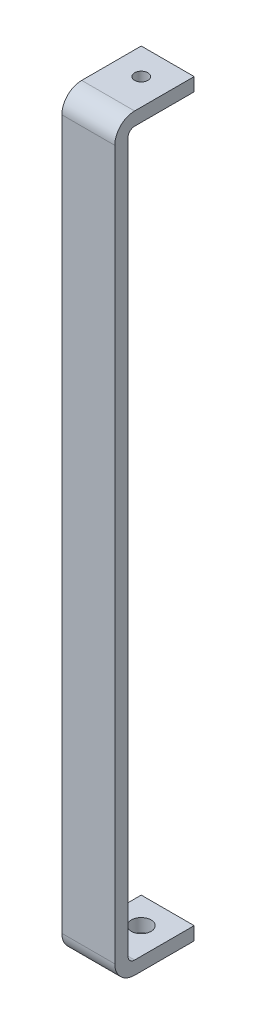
ISO-10303-21;
HEADER;
FILE_DESCRIPTION(('STEP AP214'),'2;1');
FILE_NAME('part.step','',(''),(''),'','','');
FILE_SCHEMA(('AUTOMOTIVE_DESIGN { 1 0 10303 214 1 1 1 1 }'));
ENDSEC;
DATA;
#1=APPLICATION_CONTEXT('core data for automotive mechanical design processes');
#2=APPLICATION_PROTOCOL_DEFINITION('international standard','automotive_design',2000,#1);
#3=PRODUCT_CONTEXT('',#1,'mechanical');
#4=PRODUCT('Part','Part','',(#3));
#5=PRODUCT_RELATED_PRODUCT_CATEGORY('part','',(#4));
#6=PRODUCT_DEFINITION_FORMATION('','',#4);
#7=PRODUCT_DEFINITION_CONTEXT('part definition',#1,'design');
#8=PRODUCT_DEFINITION('design','',#6,#7);
#9=PRODUCT_DEFINITION_SHAPE('','',#8);
#10=(LENGTH_UNIT() NAMED_UNIT(*) SI_UNIT(.MILLI.,.METRE.));
#11=(NAMED_UNIT(*) PLANE_ANGLE_UNIT() SI_UNIT($,.RADIAN.));
#12=(NAMED_UNIT(*) SI_UNIT($,.STERADIAN.) SOLID_ANGLE_UNIT());
#13=UNCERTAINTY_MEASURE_WITH_UNIT(LENGTH_MEASURE(1.E-05),#10,'distance_accuracy_value','');
#14=(GEOMETRIC_REPRESENTATION_CONTEXT(3) GLOBAL_UNCERTAINTY_ASSIGNED_CONTEXT((#13)) GLOBAL_UNIT_ASSIGNED_CONTEXT((#10,
#11,#12)) REPRESENTATION_CONTEXT('',''));
#15=CARTESIAN_POINT('',(0.,0.,0.));
#16=DIRECTION('',(0.,0.,1.));
#17=DIRECTION('',(1.,0.,0.));
#18=AXIS2_PLACEMENT_3D('',#15,#16,#17);
#19=CARTESIAN_POINT('',(-14.2875000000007,-172.72,3.175));
#20=DIRECTION('',(0.,0.,1.));
#21=DIRECTION('',(1.,0.,0.));
#22=AXIS2_PLACEMENT_3D('',#19,#20,#21);
#23=PLANE('',#22);
#24=DIRECTION('',(0.,-1.,0.));
#25=VECTOR('',#24,1.);
#26=CARTESIAN_POINT('',(-14.2875000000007,6.85800000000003,3.175));
#27=LINE('',#26,#25);
#28=CARTESIAN_POINT('',(-14.2875000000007,2.09550000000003,3.175));
#29=VERTEX_POINT('',#28);
#30=CARTESIAN_POINT('',(-14.2875000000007,-167.9575,3.175));
#31=VERTEX_POINT('',#30);
#32=EDGE_CURVE('E158',#29,#31,#27,.T.);
#33=ORIENTED_EDGE('',*,*,#32,.F.);
#34=DIRECTION('',(1.,0.,0.));
#35=VECTOR('',#34,1.);
#36=CARTESIAN_POINT('',(-14.2875000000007,2.09550000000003,3.175));
#37=LINE('',#36,#35);
#38=CARTESIAN_POINT('',(-1.58750000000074,2.09550000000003,3.175));
#39=VERTEX_POINT('',#38);
#40=EDGE_CURVE('E174',#29,#39,#37,.T.);
#41=ORIENTED_EDGE('',*,*,#40,.T.);
#42=DIRECTION('',(0.,1.,0.));
#43=VECTOR('',#42,1.);
#44=CARTESIAN_POINT('',(-1.58750000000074,6.85800000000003,3.175));
#45=LINE('',#44,#43);
#46=CARTESIAN_POINT('',(-1.58750000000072,-167.9575,3.175));
#47=VERTEX_POINT('',#46);
#48=EDGE_CURVE('E167',#47,#39,#45,.T.);
#49=ORIENTED_EDGE('',*,*,#48,.F.);
#50=DIRECTION('',(1.,0.,0.));
#51=VECTOR('',#50,1.);
#52=CARTESIAN_POINT('',(-14.2875000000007,-167.9575,3.175));
#53=LINE('',#52,#51);
#54=EDGE_CURVE('E172',#47,#31,#53,.F.);
#55=ORIENTED_EDGE('',*,*,#54,.T.);
#56=EDGE_LOOP('',(#33,#41,#49,#55));
#57=FACE_BOUND('',#56,.T.);
#58=ADVANCED_FACE('F33',(#57),#23,.F.);
#59=CARTESIAN_POINT('',(-14.2875000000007,3.68300000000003,-12.7));
#60=DIRECTION('',(-1.,0.,0.));
#61=DIRECTION('',(0.,0.,1.));
#62=AXIS2_PLACEMENT_3D('',#59,#60,#61);
#63=PLANE('',#62);
#64=DIRECTION('',(0.,-1.,0.));
#65=VECTOR('',#64,1.);
#66=CARTESIAN_POINT('',(-14.2875000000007,6.85800000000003,6.35));
#67=LINE('',#66,#65);
#68=CARTESIAN_POINT('',(-14.2875000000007,2.09550000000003,6.35));
#69=VERTEX_POINT('',#68);
#70=CARTESIAN_POINT('',(-14.2875000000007,-167.9575,6.35));
#71=VERTEX_POINT('',#70);
#72=EDGE_CURVE('E171',#69,#71,#67,.T.);
#73=ORIENTED_EDGE('',*,*,#72,.F.);
#74=CARTESIAN_POINT('',(-14.2875000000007,2.09550000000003,1.5875));
#75=DIRECTION('',(-1.,0.,0.));
#76=DIRECTION('',(0.,0.,1.));
#77=AXIS2_PLACEMENT_3D('',#74,#75,#76);
#78=CIRCLE('',#77,4.7625);
#79=CARTESIAN_POINT('',(-14.2875000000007,6.85800000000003,1.5875));
#80=VERTEX_POINT('',#79);
#81=EDGE_CURVE('E199',#69,#80,#78,.T.);
#82=ORIENTED_EDGE('',*,*,#81,.T.);
#83=DIRECTION('',(0.,0.,1.));
#84=VECTOR('',#83,1.);
#85=CARTESIAN_POINT('',(-14.2875000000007,6.85800000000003,-12.7));
#86=LINE('',#85,#84);
#87=CARTESIAN_POINT('',(-14.2875000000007,6.85800000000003,-12.7));
#88=VERTEX_POINT('',#87);
#89=EDGE_CURVE('E175',#88,#80,#86,.T.);
#90=ORIENTED_EDGE('',*,*,#89,.F.);
#91=DIRECTION('',(0.,-1.,0.));
#92=VECTOR('',#91,1.);
#93=CARTESIAN_POINT('',(-14.2875000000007,3.68300000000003,-12.7));
#94=LINE('',#93,#92);
#95=CARTESIAN_POINT('',(-14.2875000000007,3.68300000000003,-12.7));
#96=VERTEX_POINT('',#95);
#97=EDGE_CURVE('E241',#88,#96,#94,.T.);
#98=ORIENTED_EDGE('',*,*,#97,.T.);
#99=DIRECTION('',(0.,0.,1.));
#100=VECTOR('',#99,1.);
#101=CARTESIAN_POINT('',(-14.2875000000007,3.68300000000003,-12.7));
#102=LINE('',#101,#100);
#103=CARTESIAN_POINT('',(-14.2875000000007,3.68300000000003,1.5875));
#104=VERTEX_POINT('',#103);
#105=EDGE_CURVE('E230',#96,#104,#102,.T.);
#106=ORIENTED_EDGE('',*,*,#105,.T.);
#107=CARTESIAN_POINT('',(-14.2875000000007,2.09550000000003,1.5875));
#108=DIRECTION('',(-1.,0.,0.));
#109=DIRECTION('',(0.,0.,1.));
#110=AXIS2_PLACEMENT_3D('',#107,#108,#109);
#111=CIRCLE('',#110,1.5875);
#112=EDGE_CURVE('E185',#104,#29,#111,.F.);
#113=ORIENTED_EDGE('',*,*,#112,.T.);
#114=ORIENTED_EDGE('',*,*,#32,.T.);
#115=CARTESIAN_POINT('',(-14.2875000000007,-167.9575,1.5875));
#116=DIRECTION('',(-1.,0.,0.));
#117=DIRECTION('',(0.,0.,1.));
#118=AXIS2_PLACEMENT_3D('',#115,#116,#117);
#119=CIRCLE('',#118,1.5875);
#120=CARTESIAN_POINT('',(-14.2875000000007,-169.545,1.5875));
#121=VERTEX_POINT('',#120);
#122=EDGE_CURVE('E189',#31,#121,#119,.F.);
#123=ORIENTED_EDGE('',*,*,#122,.T.);
#124=DIRECTION('',(0.,0.,1.));
#125=VECTOR('',#124,1.);
#126=CARTESIAN_POINT('',(-14.2875000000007,-169.545,-12.7));
#127=LINE('',#126,#125);
#128=CARTESIAN_POINT('',(-14.2875000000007,-169.545,-12.7));
#129=VERTEX_POINT('',#128);
#130=EDGE_CURVE('E155',#129,#121,#127,.T.);
#131=ORIENTED_EDGE('',*,*,#130,.F.);
#132=DIRECTION('',(0.,1.,0.));
#133=VECTOR('',#132,1.);
#134=CARTESIAN_POINT('',(-14.2875000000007,-172.72,-12.7));
#135=LINE('',#134,#133);
#136=CARTESIAN_POINT('',(-14.2875000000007,-172.72,-12.7));
#137=VERTEX_POINT('',#136);
#138=EDGE_CURVE('E137',#137,#129,#135,.T.);
#139=ORIENTED_EDGE('',*,*,#138,.F.);
#140=DIRECTION('',(0.,0.,-1.));
#141=VECTOR('',#140,1.);
#142=CARTESIAN_POINT('',(-14.2875000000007,-172.72,6.35));
#143=LINE('',#142,#141);
#144=CARTESIAN_POINT('',(-14.2875000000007,-172.72,1.5875));
#145=VERTEX_POINT('',#144);
#146=EDGE_CURVE('E128',#145,#137,#143,.T.);
#147=ORIENTED_EDGE('',*,*,#146,.F.);
#148=CARTESIAN_POINT('',(-14.2875000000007,-167.9575,1.5875));
#149=DIRECTION('',(-1.,0.,0.));
#150=DIRECTION('',(0.,0.,1.));
#151=AXIS2_PLACEMENT_3D('',#148,#149,#150);
#152=CIRCLE('',#151,4.7625);
#153=EDGE_CURVE('E197',#145,#71,#152,.T.);
#154=ORIENTED_EDGE('',*,*,#153,.T.);
#155=EDGE_LOOP('',(#73,#82,#90,#98,#106,#113,#114,#123,#131,#139,#147,#154));
#156=FACE_BOUND('',#155,.T.);
#157=ADVANCED_FACE('F35',(#156),#63,.T.);
#158=CARTESIAN_POINT('',(-14.2875000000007,6.85800000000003,-12.7));
#159=DIRECTION('',(0.,1.,0.));
#160=DIRECTION('',(-1.,0.,0.));
#161=AXIS2_PLACEMENT_3D('',#158,#159,#160);
#162=PLANE('',#161);
#163=CARTESIAN_POINT('',(-7.93750000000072,6.85800000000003,-6.35));
#164=DIRECTION('',(0.,1.,0.));
#165=DIRECTION('',(0.,0.,1.));
#166=AXIS2_PLACEMENT_3D('',#163,#164,#165);
#167=CIRCLE('',#166,1.5875);
#168=CARTESIAN_POINT('',(-7.93750000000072,6.85800000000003,-4.7625));
#169=VERTEX_POINT('',#168);
#170=EDGE_CURVE('E303',#169,#169,#167,.T.);
#171=ORIENTED_EDGE('',*,*,#170,.F.);
#172=EDGE_LOOP('',(#171));
#173=FACE_BOUND('',#172,.T.);
#174=ORIENTED_EDGE('',*,*,#89,.T.);
#175=DIRECTION('',(-1.,0.,0.));
#176=VECTOR('',#175,1.);
#177=CARTESIAN_POINT('',(-14.2875000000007,6.85800000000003,1.5875));
#178=LINE('',#177,#176);
#179=CARTESIAN_POINT('',(-1.58750000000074,6.85800000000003,1.5875));
#180=VERTEX_POINT('',#179);
#181=EDGE_CURVE('E56',#80,#180,#178,.F.);
#182=ORIENTED_EDGE('',*,*,#181,.T.);
#183=DIRECTION('',(0.,0.,1.));
#184=VECTOR('',#183,1.);
#185=CARTESIAN_POINT('',(-1.58750000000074,6.85800000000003,-12.7));
#186=LINE('',#185,#184);
#187=CARTESIAN_POINT('',(-1.58750000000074,6.85800000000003,-12.7));
#188=VERTEX_POINT('',#187);
#189=EDGE_CURVE('E205',#188,#180,#186,.T.);
#190=ORIENTED_EDGE('',*,*,#189,.F.);
#191=DIRECTION('',(-1.,0.,0.));
#192=VECTOR('',#191,1.);
#193=CARTESIAN_POINT('',(-14.2875000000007,6.85800000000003,-12.7));
#194=LINE('',#193,#192);
#195=EDGE_CURVE('E221',#188,#88,#194,.T.);
#196=ORIENTED_EDGE('',*,*,#195,.T.);
#197=EDGE_LOOP('',(#174,#182,#190,#196));
#198=FACE_BOUND('',#197,.T.);
#199=ADVANCED_FACE('F219',(#173,#198),#162,.T.);
#200=CARTESIAN_POINT('',(-1.58750000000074,3.68300000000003,-12.7));
#201=DIRECTION('',(1.,0.,0.));
#202=DIRECTION('',(0.,0.,-1.));
#203=AXIS2_PLACEMENT_3D('',#200,#201,#202);
#204=PLANE('',#203);
#205=ORIENTED_EDGE('',*,*,#189,.T.);
#206=CARTESIAN_POINT('',(-1.58750000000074,2.09550000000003,1.5875));
#207=DIRECTION('',(1.,0.,0.));
#208=DIRECTION('',(0.,0.,-1.));
#209=AXIS2_PLACEMENT_3D('',#206,#207,#208);
#210=CIRCLE('',#209,4.7625);
#211=CARTESIAN_POINT('',(-1.58750000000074,2.09550000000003,6.35));
#212=VERTEX_POINT('',#211);
#213=EDGE_CURVE('E41',#180,#212,#210,.T.);
#214=ORIENTED_EDGE('',*,*,#213,.T.);
#215=DIRECTION('',(0.,1.,0.));
#216=VECTOR('',#215,1.);
#217=CARTESIAN_POINT('',(-1.58750000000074,6.85800000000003,6.35));
#218=LINE('',#217,#216);
#219=CARTESIAN_POINT('',(-1.58750000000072,-167.9575,6.35));
#220=VERTEX_POINT('',#219);
#221=EDGE_CURVE('E129',#220,#212,#218,.T.);
#222=ORIENTED_EDGE('',*,*,#221,.F.);
#223=CARTESIAN_POINT('',(-1.58750000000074,-167.9575,1.5875));
#224=DIRECTION('',(1.,0.,0.));
#225=DIRECTION('',(0.,0.,-1.));
#226=AXIS2_PLACEMENT_3D('',#223,#224,#225);
#227=CIRCLE('',#226,4.7625);
#228=CARTESIAN_POINT('',(-1.58750000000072,-172.72,1.5875));
#229=VERTEX_POINT('',#228);
#230=EDGE_CURVE('E48',#220,#229,#227,.T.);
#231=ORIENTED_EDGE('',*,*,#230,.T.);
#232=DIRECTION('',(0.,0.,-1.));
#233=VECTOR('',#232,1.);
#234=CARTESIAN_POINT('',(-1.58750000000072,-172.72,6.35));
#235=LINE('',#234,#233);
#236=CARTESIAN_POINT('',(-1.58750000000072,-172.72,-12.7));
#237=VERTEX_POINT('',#236);
#238=EDGE_CURVE('E120',#229,#237,#235,.T.);
#239=ORIENTED_EDGE('',*,*,#238,.T.);
#240=DIRECTION('',(0.,-1.,0.));
#241=VECTOR('',#240,1.);
#242=CARTESIAN_POINT('',(-1.58750000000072,-172.72,-12.7));
#243=LINE('',#242,#241);
#244=CARTESIAN_POINT('',(-1.58750000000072,-169.545,-12.7));
#245=VERTEX_POINT('',#244);
#246=EDGE_CURVE('E125',#245,#237,#243,.T.);
#247=ORIENTED_EDGE('',*,*,#246,.F.);
#248=DIRECTION('',(0.,0.,1.));
#249=VECTOR('',#248,1.);
#250=CARTESIAN_POINT('',(-1.58750000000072,-169.545,-12.7));
#251=LINE('',#250,#249);
#252=CARTESIAN_POINT('',(-1.58750000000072,-169.545,1.5875));
#253=VERTEX_POINT('',#252);
#254=EDGE_CURVE('E153',#245,#253,#251,.T.);
#255=ORIENTED_EDGE('',*,*,#254,.T.);
#256=CARTESIAN_POINT('',(-1.58750000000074,-167.9575,1.5875));
#257=DIRECTION('',(1.,0.,0.));
#258=DIRECTION('',(0.,0.,-1.));
#259=AXIS2_PLACEMENT_3D('',#256,#257,#258);
#260=CIRCLE('',#259,1.5875);
#261=EDGE_CURVE('E187',#253,#47,#260,.F.);
#262=ORIENTED_EDGE('',*,*,#261,.T.);
#263=ORIENTED_EDGE('',*,*,#48,.T.);
#264=CARTESIAN_POINT('',(-1.58750000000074,2.09550000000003,1.5875));
#265=DIRECTION('',(1.,0.,0.));
#266=DIRECTION('',(0.,0.,-1.));
#267=AXIS2_PLACEMENT_3D('',#264,#265,#266);
#268=CIRCLE('',#267,1.5875);
#269=CARTESIAN_POINT('',(-1.58750000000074,3.68300000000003,1.5875));
#270=VERTEX_POINT('',#269);
#271=EDGE_CURVE('E183',#39,#270,#268,.F.);
#272=ORIENTED_EDGE('',*,*,#271,.T.);
#273=DIRECTION('',(0.,0.,1.));
#274=VECTOR('',#273,1.);
#275=CARTESIAN_POINT('',(-1.58750000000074,3.68300000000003,-12.7));
#276=LINE('',#275,#274);
#277=CARTESIAN_POINT('',(-1.58750000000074,3.68300000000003,-12.7));
#278=VERTEX_POINT('',#277);
#279=EDGE_CURVE('E223',#278,#270,#276,.T.);
#280=ORIENTED_EDGE('',*,*,#279,.F.);
#281=DIRECTION('',(0.,1.,0.));
#282=VECTOR('',#281,1.);
#283=CARTESIAN_POINT('',(-1.58750000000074,3.68300000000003,-12.7));
#284=LINE('',#283,#282);
#285=EDGE_CURVE('E237',#278,#188,#284,.T.);
#286=ORIENTED_EDGE('',*,*,#285,.T.);
#287=EDGE_LOOP('',(#205,#214,#222,#231,#239,#247,#255,#262,#263,#272,#280,#286));
#288=FACE_BOUND('',#287,.T.);
#289=ADVANCED_FACE('F122',(#288),#204,.T.);
#290=CARTESIAN_POINT('',(-14.2875000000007,3.68300000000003,-12.7));
#291=DIRECTION('',(0.,-1.,0.));
#292=DIRECTION('',(1.,0.,0.));
#293=AXIS2_PLACEMENT_3D('',#290,#291,#292);
#294=PLANE('',#293);
#295=CARTESIAN_POINT('',(-7.93750000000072,3.68300000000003,-6.35));
#296=DIRECTION('',(0.,-1.,0.));
#297=DIRECTION('',(1.,0.,0.));
#298=AXIS2_PLACEMENT_3D('',#295,#296,#297);
#299=CIRCLE('',#298,1.5875);
#300=CARTESIAN_POINT('',(-6.35000000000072,3.68300000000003,-6.35));
#301=VERTEX_POINT('',#300);
#302=EDGE_CURVE('E168',#301,#301,#299,.T.);
#303=ORIENTED_EDGE('',*,*,#302,.F.);
#304=EDGE_LOOP('',(#303));
#305=FACE_BOUND('',#304,.T.);
#306=ORIENTED_EDGE('',*,*,#279,.T.);
#307=DIRECTION('',(1.,0.,0.));
#308=VECTOR('',#307,1.);
#309=CARTESIAN_POINT('',(-14.2875000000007,3.68300000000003,1.5875));
#310=LINE('',#309,#308);
#311=EDGE_CURVE('E178',#270,#104,#310,.F.);
#312=ORIENTED_EDGE('',*,*,#311,.T.);
#313=ORIENTED_EDGE('',*,*,#105,.F.);
#314=DIRECTION('',(1.,0.,0.));
#315=VECTOR('',#314,1.);
#316=CARTESIAN_POINT('',(-14.2875000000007,3.68300000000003,-12.7));
#317=LINE('',#316,#315);
#318=EDGE_CURVE('E238',#96,#278,#317,.T.);
#319=ORIENTED_EDGE('',*,*,#318,.T.);
#320=EDGE_LOOP('',(#306,#312,#313,#319));
#321=FACE_BOUND('',#320,.T.);
#322=ADVANCED_FACE('F287',(#305,#321),#294,.T.);
#323=CARTESIAN_POINT('',(-14.2875000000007,6.85800000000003,-12.7));
#324=DIRECTION('',(0.,0.,-1.));
#325=DIRECTION('',(-1.,0.,0.));
#326=AXIS2_PLACEMENT_3D('',#323,#324,#325);
#327=PLANE('',#326);
#328=ORIENTED_EDGE('',*,*,#97,.F.);
#329=ORIENTED_EDGE('',*,*,#195,.F.);
#330=ORIENTED_EDGE('',*,*,#285,.F.);
#331=ORIENTED_EDGE('',*,*,#318,.F.);
#332=EDGE_LOOP('',(#328,#329,#330,#331));
#333=FACE_BOUND('',#332,.T.);
#334=ADVANCED_FACE('F283',(#333),#327,.T.);
#335=CARTESIAN_POINT('',(-14.2875000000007,-172.72,6.35));
#336=DIRECTION('',(0.,1.,0.));
#337=DIRECTION('',(0.,0.,1.));
#338=AXIS2_PLACEMENT_3D('',#335,#336,#337);
#339=PLANE('',#338);
#340=CARTESIAN_POINT('',(-7.93750000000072,-172.72,-6.35));
#341=DIRECTION('',(0.,-1.,0.));
#342=DIRECTION('',(0.,0.,-1.));
#343=AXIS2_PLACEMENT_3D('',#340,#341,#342);
#344=CIRCLE('',#343,2.3749);
#345=CARTESIAN_POINT('',(-7.93750000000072,-172.72,-8.7249));
#346=VERTEX_POINT('',#345);
#347=EDGE_CURVE('E146',#346,#346,#344,.T.);
#348=ORIENTED_EDGE('',*,*,#347,.F.);
#349=EDGE_LOOP('',(#348));
#350=FACE_BOUND('',#349,.T.);
#351=ORIENTED_EDGE('',*,*,#238,.F.);
#352=DIRECTION('',(1.,0.,0.));
#353=VECTOR('',#352,1.);
#354=CARTESIAN_POINT('',(-14.2875000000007,-172.72,1.5875));
#355=LINE('',#354,#353);
#356=EDGE_CURVE('E11',#229,#145,#355,.F.);
#357=ORIENTED_EDGE('',*,*,#356,.T.);
#358=ORIENTED_EDGE('',*,*,#146,.T.);
#359=DIRECTION('',(-1.,0.,0.));
#360=VECTOR('',#359,1.);
#361=CARTESIAN_POINT('',(-1.58750000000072,-172.72,-12.7));
#362=LINE('',#361,#360);
#363=EDGE_CURVE('E132',#237,#137,#362,.T.);
#364=ORIENTED_EDGE('',*,*,#363,.F.);
#365=EDGE_LOOP('',(#351,#357,#358,#364));
#366=FACE_BOUND('',#365,.T.);
#367=ADVANCED_FACE('F133',(#350,#366),#339,.F.);
#368=CARTESIAN_POINT('',(-14.2875000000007,-172.72,6.35));
#369=DIRECTION('',(0.,0.,1.));
#370=DIRECTION('',(1.,0.,0.));
#371=AXIS2_PLACEMENT_3D('',#368,#369,#370);
#372=PLANE('',#371);
#373=ORIENTED_EDGE('',*,*,#221,.T.);
#374=DIRECTION('',(-1.,0.,0.));
#375=VECTOR('',#374,1.);
#376=CARTESIAN_POINT('',(-14.2875000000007,2.09550000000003,6.35));
#377=LINE('',#376,#375);
#378=EDGE_CURVE('E194',#212,#69,#377,.T.);
#379=ORIENTED_EDGE('',*,*,#378,.T.);
#380=ORIENTED_EDGE('',*,*,#72,.T.);
#381=DIRECTION('',(1.,0.,0.));
#382=VECTOR('',#381,1.);
#383=CARTESIAN_POINT('',(-1.58750000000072,-167.9575,6.35));
#384=LINE('',#383,#382);
#385=EDGE_CURVE('E191',#71,#220,#384,.T.);
#386=ORIENTED_EDGE('',*,*,#385,.T.);
#387=EDGE_LOOP('',(#373,#379,#380,#386));
#388=FACE_BOUND('',#387,.T.);
#389=ADVANCED_FACE('F209',(#388),#372,.T.);
#390=CARTESIAN_POINT('',(-1.58750000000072,-169.545,-12.7));
#391=DIRECTION('',(0.,-1.,0.));
#392=DIRECTION('',(0.,0.,-1.));
#393=AXIS2_PLACEMENT_3D('',#390,#391,#392);
#394=PLANE('',#393);
#395=CARTESIAN_POINT('',(-7.93750000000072,-169.545,-6.35));
#396=DIRECTION('',(0.,-1.,0.));
#397=DIRECTION('',(0.,0.,-1.));
#398=AXIS2_PLACEMENT_3D('',#395,#396,#397);
#399=CIRCLE('',#398,2.3749);
#400=CARTESIAN_POINT('',(-7.93750000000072,-169.545,-8.7249));
#401=VERTEX_POINT('',#400);
#402=EDGE_CURVE('E143',#401,#401,#399,.T.);
#403=ORIENTED_EDGE('',*,*,#402,.T.);
#404=EDGE_LOOP('',(#403));
#405=FACE_BOUND('',#404,.T.);
#406=ORIENTED_EDGE('',*,*,#130,.T.);
#407=DIRECTION('',(1.,0.,0.));
#408=VECTOR('',#407,1.);
#409=CARTESIAN_POINT('',(-1.58750000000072,-169.545,1.5875));
#410=LINE('',#409,#408);
#411=EDGE_CURVE('E180',#121,#253,#410,.T.);
#412=ORIENTED_EDGE('',*,*,#411,.T.);
#413=ORIENTED_EDGE('',*,*,#254,.F.);
#414=DIRECTION('',(1.,0.,0.));
#415=VECTOR('',#414,1.);
#416=CARTESIAN_POINT('',(-1.58750000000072,-169.545,-12.7));
#417=LINE('',#416,#415);
#418=EDGE_CURVE('E141',#129,#245,#417,.T.);
#419=ORIENTED_EDGE('',*,*,#418,.F.);
#420=EDGE_LOOP('',(#406,#412,#413,#419));
#421=FACE_BOUND('',#420,.T.);
#422=ADVANCED_FACE('F252',(#405,#421),#394,.F.);
#423=CARTESIAN_POINT('',(-1.58750000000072,-169.545,-12.7));
#424=DIRECTION('',(0.,0.,1.));
#425=DIRECTION('',(1.,0.,0.));
#426=AXIS2_PLACEMENT_3D('',#423,#424,#425);
#427=PLANE('',#426);
#428=ORIENTED_EDGE('',*,*,#246,.T.);
#429=ORIENTED_EDGE('',*,*,#363,.T.);
#430=ORIENTED_EDGE('',*,*,#138,.T.);
#431=ORIENTED_EDGE('',*,*,#418,.T.);
#432=EDGE_LOOP('',(#428,#429,#430,#431));
#433=FACE_BOUND('',#432,.T.);
#434=ADVANCED_FACE('F139',(#433),#427,.F.);
#435=CARTESIAN_POINT('',(-7.93750000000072,-160.02,-6.35));
#436=DIRECTION('',(0.,-1.,0.));
#437=DIRECTION('',(0.,0.,-1.));
#438=AXIS2_PLACEMENT_3D('',#435,#436,#437);
#439=CYLINDRICAL_SURFACE('',#438,2.3749);
#440=ORIENTED_EDGE('',*,*,#347,.T.);
#441=EDGE_LOOP('',(#440));
#442=FACE_BOUND('',#441,.T.);
#443=ORIENTED_EDGE('',*,*,#402,.F.);
#444=EDGE_LOOP('',(#443));
#445=FACE_BOUND('',#444,.T.);
#446=ADVANCED_FACE('F309',(#442,#445),#439,.F.);
#447=CARTESIAN_POINT('',(-7.93750000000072,-5.84199999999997,-6.35));
#448=DIRECTION('',(0.,1.,0.));
#449=DIRECTION('',(0.,0.,1.));
#450=AXIS2_PLACEMENT_3D('',#447,#448,#449);
#451=CYLINDRICAL_SURFACE('',#450,1.5875);
#452=ORIENTED_EDGE('',*,*,#302,.T.);
#453=EDGE_LOOP('',(#452));
#454=FACE_BOUND('',#453,.T.);
#455=ORIENTED_EDGE('',*,*,#170,.T.);
#456=EDGE_LOOP('',(#455));
#457=FACE_BOUND('',#456,.T.);
#458=ADVANCED_FACE('F268',(#454,#457),#451,.F.);
#459=CARTESIAN_POINT('',(-14.2875000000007,2.09550000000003,1.5875));
#460=DIRECTION('',(1.,0.,0.));
#461=DIRECTION('',(0.,1.,0.));
#462=AXIS2_PLACEMENT_3D('',#459,#460,#461);
#463=CYLINDRICAL_SURFACE('',#462,1.5875);
#464=ORIENTED_EDGE('',*,*,#112,.F.);
#465=ORIENTED_EDGE('',*,*,#311,.F.);
#466=ORIENTED_EDGE('',*,*,#271,.F.);
#467=ORIENTED_EDGE('',*,*,#40,.F.);
#468=EDGE_LOOP('',(#464,#465,#466,#467));
#469=FACE_BOUND('',#468,.T.);
#470=ADVANCED_FACE('F261',(#469),#463,.F.);
#471=CARTESIAN_POINT('',(-1.58750000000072,-167.9575,1.5875));
#472=DIRECTION('',(-1.,0.,0.));
#473=DIRECTION('',(0.,0.,1.));
#474=AXIS2_PLACEMENT_3D('',#471,#472,#473);
#475=CYLINDRICAL_SURFACE('',#474,1.5875);
#476=ORIENTED_EDGE('',*,*,#122,.F.);
#477=ORIENTED_EDGE('',*,*,#54,.F.);
#478=ORIENTED_EDGE('',*,*,#261,.F.);
#479=ORIENTED_EDGE('',*,*,#411,.F.);
#480=EDGE_LOOP('',(#476,#477,#478,#479));
#481=FACE_BOUND('',#480,.T.);
#482=ADVANCED_FACE('F259',(#481),#475,.F.);
#483=CARTESIAN_POINT('',(-14.2875000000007,2.09550000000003,1.5875));
#484=DIRECTION('',(-1.,0.,0.));
#485=DIRECTION('',(0.,-1.,0.));
#486=AXIS2_PLACEMENT_3D('',#483,#484,#485);
#487=CYLINDRICAL_SURFACE('',#486,4.7625);
#488=ORIENTED_EDGE('',*,*,#213,.F.);
#489=ORIENTED_EDGE('',*,*,#181,.F.);
#490=ORIENTED_EDGE('',*,*,#81,.F.);
#491=ORIENTED_EDGE('',*,*,#378,.F.);
#492=EDGE_LOOP('',(#488,#489,#490,#491));
#493=FACE_BOUND('',#492,.T.);
#494=ADVANCED_FACE('F214',(#493),#487,.T.);
#495=CARTESIAN_POINT('',(-14.2875000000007,-167.9575,1.5875));
#496=DIRECTION('',(-1.,0.,0.));
#497=DIRECTION('',(0.,0.,1.));
#498=AXIS2_PLACEMENT_3D('',#495,#496,#497);
#499=CYLINDRICAL_SURFACE('',#498,4.7625);
#500=ORIENTED_EDGE('',*,*,#153,.F.);
#501=ORIENTED_EDGE('',*,*,#356,.F.);
#502=ORIENTED_EDGE('',*,*,#230,.F.);
#503=ORIENTED_EDGE('',*,*,#385,.F.);
#504=EDGE_LOOP('',(#500,#501,#502,#503));
#505=FACE_BOUND('',#504,.T.);
#506=ADVANCED_FACE('F247',(#505),#499,.T.);
#507=CLOSED_SHELL('',(#58,#157,#199,#289,#322,#334,#367,#389,#422,#434,#446,#458,#470,#482,#494,#506));
#508=MANIFOLD_SOLID_BREP('B2',#507);
#509=ADVANCED_BREP_SHAPE_REPRESENTATION('',(#18,#508),#14);
#510=SHAPE_DEFINITION_REPRESENTATION(#9,#509);
ENDSEC;
END-ISO-10303-21;
